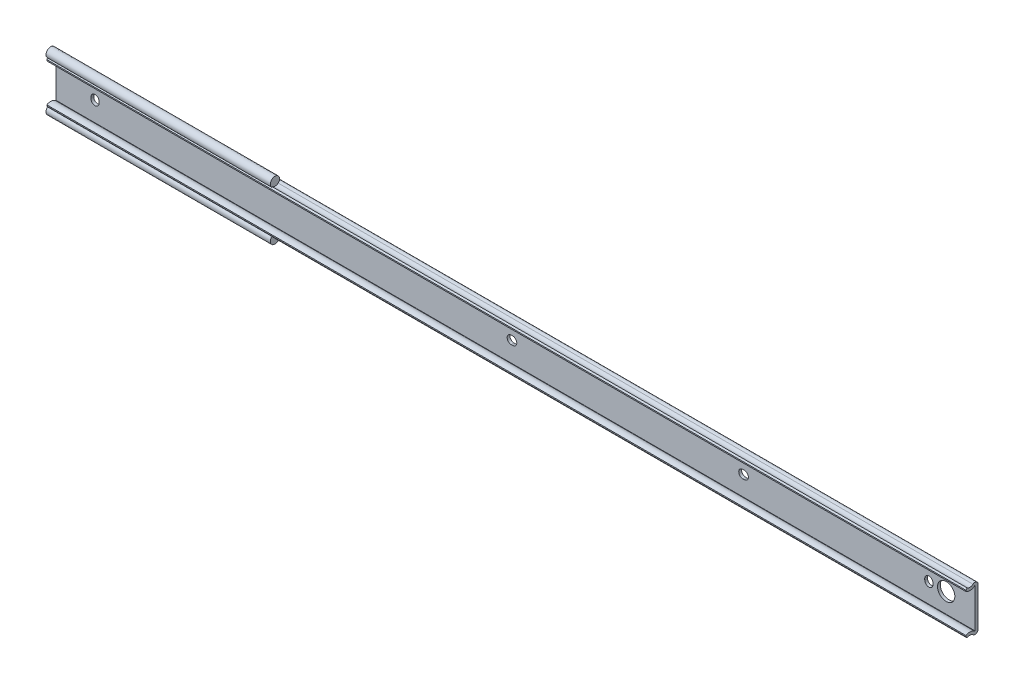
ISO-10303-21;
HEADER;
FILE_DESCRIPTION(('STEP AP214'),'2;1');
FILE_NAME('part.step','',(''),(''),'','','');
FILE_SCHEMA(('AUTOMOTIVE_DESIGN { 1 0 10303 214 1 1 1 1 }'));
ENDSEC;
DATA;
#1=APPLICATION_CONTEXT('core data for automotive mechanical design processes');
#2=APPLICATION_PROTOCOL_DEFINITION('international standard','automotive_design',2000,#1);
#3=PRODUCT_CONTEXT('',#1,'mechanical');
#4=PRODUCT('Part','Part','',(#3));
#5=PRODUCT_RELATED_PRODUCT_CATEGORY('part','',(#4));
#6=PRODUCT_DEFINITION_FORMATION('','',#4);
#7=PRODUCT_DEFINITION_CONTEXT('part definition',#1,'design');
#8=PRODUCT_DEFINITION('design','',#6,#7);
#9=PRODUCT_DEFINITION_SHAPE('','',#8);
#10=(LENGTH_UNIT() NAMED_UNIT(*) SI_UNIT(.MILLI.,.METRE.));
#11=(NAMED_UNIT(*) PLANE_ANGLE_UNIT() SI_UNIT($,.RADIAN.));
#12=(NAMED_UNIT(*) SI_UNIT($,.STERADIAN.) SOLID_ANGLE_UNIT());
#13=UNCERTAINTY_MEASURE_WITH_UNIT(LENGTH_MEASURE(1.E-05),#10,'distance_accuracy_value','');
#14=(GEOMETRIC_REPRESENTATION_CONTEXT(3) GLOBAL_UNCERTAINTY_ASSIGNED_CONTEXT((#13)) GLOBAL_UNIT_ASSIGNED_CONTEXT((#10,
#11,#12)) REPRESENTATION_CONTEXT('',''));
#15=CARTESIAN_POINT('',(0.,0.,0.));
#16=DIRECTION('',(0.,0.,1.));
#17=DIRECTION('',(1.,0.,0.));
#18=AXIS2_PLACEMENT_3D('',#15,#16,#17);
#19=CARTESIAN_POINT('',(-21.4,13.9150000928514,4.44999970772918));
#20=DIRECTION('',(1.,0.,0.));
#21=DIRECTION('',(0.,0.,-1.));
#22=AXIS2_PLACEMENT_3D('',#19,#20,#21);
#23=CYLINDRICAL_SURFACE('',#22,2.55000008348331);
#24=DIRECTION('',(1.,0.,0.));
#25=VECTOR('',#24,1.);
#26=CARTESIAN_POINT('',(-21.4,12.0053612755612,2.76009438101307));
#27=LINE('',#26,#25);
#28=CARTESIAN_POINT('',(101.6,12.0053612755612,2.76009438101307));
#29=VERTEX_POINT('',#28);
#30=CARTESIAN_POINT('',(482.6,12.0053612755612,2.76009438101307));
#31=VERTEX_POINT('',#30);
#32=EDGE_CURVE('E402',#29,#31,#27,.T.);
#33=ORIENTED_EDGE('',*,*,#32,.F.);
#34=CARTESIAN_POINT('',(101.6,13.9150000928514,4.44999970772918));
#35=DIRECTION('',(-1.,0.,0.));
#36=DIRECTION('',(0.,0.,1.));
#37=AXIS2_PLACEMENT_3D('',#34,#35,#36);
#38=CIRCLE('',#37,2.55000008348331);
#39=CARTESIAN_POINT('',(101.6,11.8784794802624,5.98462807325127));
#40=VERTEX_POINT('',#39);
#41=EDGE_CURVE('E466',#29,#40,#38,.T.);
#42=ORIENTED_EDGE('',*,*,#41,.T.);
#43=DIRECTION('',(1.,0.,0.));
#44=VECTOR('',#43,1.);
#45=CARTESIAN_POINT('',(-21.4,11.8784794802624,5.98462807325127));
#46=LINE('',#45,#44);
#47=CARTESIAN_POINT('',(482.6,11.8784794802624,5.98462807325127));
#48=VERTEX_POINT('',#47);
#49=EDGE_CURVE('E430',#40,#48,#46,.T.);
#50=ORIENTED_EDGE('',*,*,#49,.T.);
#51=CARTESIAN_POINT('',(482.6,13.9150000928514,4.44999970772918));
#52=DIRECTION('',(-1.,0.,0.));
#53=DIRECTION('',(0.,0.,-1.));
#54=AXIS2_PLACEMENT_3D('',#51,#52,#53);
#55=CIRCLE('',#54,2.55000008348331);
#56=EDGE_CURVE('E334',#31,#48,#55,.T.);
#57=ORIENTED_EDGE('',*,*,#56,.F.);
#58=EDGE_LOOP('',(#33,#42,#50,#57));
#59=FACE_BOUND('',#58,.T.);
#60=ADVANCED_FACE('F14',(#59),#23,.F.);
#61=CARTESIAN_POINT('',(-21.4,10.762224,1.65999962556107));
#62=DIRECTION('',(1.,0.,0.));
#63=DIRECTION('',(0.,0.,-1.));
#64=AXIS2_PLACEMENT_3D('',#61,#62,#63);
#65=CYLINDRICAL_SURFACE('',#64,1.65999962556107);
#66=DIRECTION('',(-1.,0.,0.));
#67=VECTOR('',#66,1.);
#68=CARTESIAN_POINT('',(40.1,12.2965303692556,2.29364205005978));
#69=LINE('',#68,#67);
#70=CARTESIAN_POINT('',(101.6,12.2965303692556,2.29364205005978));
#71=VERTEX_POINT('',#70);
#72=CARTESIAN_POINT('',(-21.4,12.2965303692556,2.29364205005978));
#73=VERTEX_POINT('',#72);
#74=EDGE_CURVE('E273',#71,#73,#69,.T.);
#75=ORIENTED_EDGE('',*,*,#74,.F.);
#76=CARTESIAN_POINT('',(101.6,10.762224,1.65999962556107));
#77=DIRECTION('',(-1.,0.,0.));
#78=DIRECTION('',(0.,0.,1.));
#79=AXIS2_PLACEMENT_3D('',#76,#77,#78);
#80=CIRCLE('',#79,1.65999962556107);
#81=EDGE_CURVE('E501',#71,#29,#80,.F.);
#82=ORIENTED_EDGE('',*,*,#81,.T.);
#83=ORIENTED_EDGE('',*,*,#32,.T.);
#84=CARTESIAN_POINT('',(482.6,10.762224,1.65999962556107));
#85=DIRECTION('',(1.,0.,0.));
#86=DIRECTION('',(0.,0.,-1.));
#87=AXIS2_PLACEMENT_3D('',#84,#85,#86);
#88=CIRCLE('',#87,1.65999962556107);
#89=CARTESIAN_POINT('',(482.6,10.762224,0.));
#90=VERTEX_POINT('',#89);
#91=EDGE_CURVE('E331',#90,#31,#88,.T.);
#92=ORIENTED_EDGE('',*,*,#91,.F.);
#93=DIRECTION('',(1.,0.,0.));
#94=VECTOR('',#93,1.);
#95=CARTESIAN_POINT('',(-21.4,10.762224,0.));
#96=LINE('',#95,#94);
#97=CARTESIAN_POINT('',(-21.4,10.762224,0.));
#98=VERTEX_POINT('',#97);
#99=EDGE_CURVE('E403',#98,#90,#96,.T.);
#100=ORIENTED_EDGE('',*,*,#99,.F.);
#101=CARTESIAN_POINT('',(-21.4,10.762224,1.65999962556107));
#102=DIRECTION('',(1.,0.,0.));
#103=DIRECTION('',(0.,0.,-1.));
#104=AXIS2_PLACEMENT_3D('',#101,#102,#103);
#105=CIRCLE('',#104,1.65999962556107);
#106=EDGE_CURVE('E372',#98,#73,#105,.T.);
#107=ORIENTED_EDGE('',*,*,#106,.T.);
#108=EDGE_LOOP('',(#75,#82,#83,#92,#100,#107));
#109=FACE_BOUND('',#108,.T.);
#110=ADVANCED_FACE('F16',(#109),#65,.T.);
#111=CARTESIAN_POINT('',(-21.4,-10.7622240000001,0.));
#112=DIRECTION('',(0.,0.,-1.));
#113=DIRECTION('',(-1.,0.,0.));
#114=AXIS2_PLACEMENT_3D('',#111,#112,#113);
#115=PLANE('',#114);
#116=CARTESIAN_POINT('',(466.7,0.,0.));
#117=DIRECTION('',(0.,0.,-1.));
#118=DIRECTION('',(-1.,0.,0.));
#119=AXIS2_PLACEMENT_3D('',#116,#117,#118);
#120=CIRCLE('',#119,4.75);
#121=CARTESIAN_POINT('',(461.95,0.,0.));
#122=VERTEX_POINT('',#121);
#123=EDGE_CURVE('E306',#122,#122,#120,.T.);
#124=ORIENTED_EDGE('',*,*,#123,.F.);
#125=EDGE_LOOP('',(#124));
#126=FACE_BOUND('',#125,.T.);
#127=CARTESIAN_POINT('',(229.000924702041,0.250209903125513,0.));
#128=DIRECTION('',(0.,0.,-1.));
#129=DIRECTION('',(-1.,0.,0.));
#130=AXIS2_PLACEMENT_3D('',#127,#128,#129);
#131=CIRCLE('',#130,2.25);
#132=CARTESIAN_POINT('',(229.000924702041,2.50020990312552,0.));
#133=VERTEX_POINT('',#132);
#134=CARTESIAN_POINT('',(229.000924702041,-1.99979009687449,0.));
#135=VERTEX_POINT('',#134);
#136=EDGE_CURVE('E270',#133,#135,#131,.T.);
#137=ORIENTED_EDGE('',*,*,#136,.F.);
#138=DIRECTION('',(1.,0.,0.));
#139=VECTOR('',#138,1.);
#140=CARTESIAN_POINT('',(229.000924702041,2.50020990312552,0.));
#141=LINE('',#140,#139);
#142=CARTESIAN_POINT('',(228.200924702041,2.50020990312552,0.));
#143=VERTEX_POINT('',#142);
#144=EDGE_CURVE('E279',#143,#133,#141,.T.);
#145=ORIENTED_EDGE('',*,*,#144,.F.);
#146=CARTESIAN_POINT('',(228.200924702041,0.250209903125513,0.));
#147=DIRECTION('',(0.,0.,-1.));
#148=DIRECTION('',(-1.,0.,0.));
#149=AXIS2_PLACEMENT_3D('',#146,#147,#148);
#150=CIRCLE('',#149,2.25);
#151=CARTESIAN_POINT('',(228.200924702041,-1.99979009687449,0.));
#152=VERTEX_POINT('',#151);
#153=EDGE_CURVE('E276',#152,#143,#150,.T.);
#154=ORIENTED_EDGE('',*,*,#153,.F.);
#155=DIRECTION('',(-1.,0.,0.));
#156=VECTOR('',#155,1.);
#157=CARTESIAN_POINT('',(229.000924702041,-1.99979009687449,0.));
#158=LINE('',#157,#156);
#159=EDGE_CURVE('E272',#135,#152,#158,.T.);
#160=ORIENTED_EDGE('',*,*,#159,.F.);
#161=EDGE_LOOP('',(#137,#145,#154,#160));
#162=FACE_BOUND('',#161,.T.);
#163=CARTESIAN_POINT('',(356.,0.,0.));
#164=DIRECTION('',(0.,0.,-1.));
#165=DIRECTION('',(-1.,0.,0.));
#166=AXIS2_PLACEMENT_3D('',#163,#164,#165);
#167=CIRCLE('',#166,2.25);
#168=CARTESIAN_POINT('',(356.,2.24999999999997,0.));
#169=VERTEX_POINT('',#168);
#170=CARTESIAN_POINT('',(356.,-2.25000000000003,0.));
#171=VERTEX_POINT('',#170);
#172=EDGE_CURVE('E255',#169,#171,#167,.T.);
#173=ORIENTED_EDGE('',*,*,#172,.F.);
#174=DIRECTION('',(1.,0.,0.));
#175=VECTOR('',#174,1.);
#176=CARTESIAN_POINT('',(356.,2.24999999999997,0.));
#177=LINE('',#176,#175);
#178=CARTESIAN_POINT('',(355.2,2.24999999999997,0.));
#179=VERTEX_POINT('',#178);
#180=EDGE_CURVE('E260',#179,#169,#177,.T.);
#181=ORIENTED_EDGE('',*,*,#180,.F.);
#182=CARTESIAN_POINT('',(355.2,0.,0.));
#183=DIRECTION('',(0.,0.,-1.));
#184=DIRECTION('',(-1.,0.,0.));
#185=AXIS2_PLACEMENT_3D('',#182,#183,#184);
#186=CIRCLE('',#185,2.25);
#187=CARTESIAN_POINT('',(355.2,-2.25000000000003,0.));
#188=VERTEX_POINT('',#187);
#189=EDGE_CURVE('E239',#188,#179,#186,.T.);
#190=ORIENTED_EDGE('',*,*,#189,.F.);
#191=DIRECTION('',(-1.,0.,0.));
#192=VECTOR('',#191,1.);
#193=CARTESIAN_POINT('',(356.,-2.25000000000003,0.));
#194=LINE('',#193,#192);
#195=EDGE_CURVE('E250',#171,#188,#194,.T.);
#196=ORIENTED_EDGE('',*,*,#195,.F.);
#197=EDGE_LOOP('',(#173,#181,#190,#196));
#198=FACE_BOUND('',#197,.T.);
#199=CARTESIAN_POINT('',(0.,0.4,0.));
#200=DIRECTION('',(0.,0.,-1.));
#201=DIRECTION('',(-1.,0.,0.));
#202=AXIS2_PLACEMENT_3D('',#199,#200,#201);
#203=CIRCLE('',#202,2.25000000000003);
#204=CARTESIAN_POINT('',(-2.25000000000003,0.4,0.));
#205=VERTEX_POINT('',#204);
#206=CARTESIAN_POINT('',(2.25000000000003,0.4,0.));
#207=VERTEX_POINT('',#206);
#208=EDGE_CURVE('E267',#205,#207,#203,.T.);
#209=ORIENTED_EDGE('',*,*,#208,.F.);
#210=DIRECTION('',(0.,1.,0.));
#211=VECTOR('',#210,1.);
#212=CARTESIAN_POINT('',(-2.25000000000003,0.4,0.));
#213=LINE('',#212,#211);
#214=CARTESIAN_POINT('',(-2.25000000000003,-0.4,0.));
#215=VERTEX_POINT('',#214);
#216=EDGE_CURVE('E320',#215,#205,#213,.T.);
#217=ORIENTED_EDGE('',*,*,#216,.F.);
#218=CARTESIAN_POINT('',(0.,-0.4,0.));
#219=DIRECTION('',(0.,0.,-1.));
#220=DIRECTION('',(-1.,0.,0.));
#221=AXIS2_PLACEMENT_3D('',#218,#219,#220);
#222=CIRCLE('',#221,2.25000000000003);
#223=CARTESIAN_POINT('',(2.25000000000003,-0.4,0.));
#224=VERTEX_POINT('',#223);
#225=EDGE_CURVE('E317',#224,#215,#222,.T.);
#226=ORIENTED_EDGE('',*,*,#225,.F.);
#227=DIRECTION('',(0.,-1.,0.));
#228=VECTOR('',#227,1.);
#229=CARTESIAN_POINT('',(2.25000000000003,0.4,0.));
#230=LINE('',#229,#228);
#231=EDGE_CURVE('E314',#207,#224,#230,.T.);
#232=ORIENTED_EDGE('',*,*,#231,.F.);
#233=EDGE_LOOP('',(#209,#217,#226,#232));
#234=FACE_BOUND('',#233,.T.);
#235=CARTESIAN_POINT('',(457.2,0.399999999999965,0.));
#236=DIRECTION('',(0.,0.,-1.));
#237=DIRECTION('',(-1.,0.,0.));
#238=AXIS2_PLACEMENT_3D('',#235,#236,#237);
#239=CIRCLE('',#238,2.25);
#240=CARTESIAN_POINT('',(454.95,0.399999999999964,0.));
#241=VERTEX_POINT('',#240);
#242=CARTESIAN_POINT('',(459.45,0.399999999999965,0.));
#243=VERTEX_POINT('',#242);
#244=EDGE_CURVE('E291',#241,#243,#239,.T.);
#245=ORIENTED_EDGE('',*,*,#244,.F.);
#246=DIRECTION('',(0.,1.,0.));
#247=VECTOR('',#246,1.);
#248=CARTESIAN_POINT('',(454.95,0.399999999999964,0.));
#249=LINE('',#248,#247);
#250=CARTESIAN_POINT('',(454.95,-0.400000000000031,0.));
#251=VERTEX_POINT('',#250);
#252=EDGE_CURVE('E300',#251,#241,#249,.T.);
#253=ORIENTED_EDGE('',*,*,#252,.F.);
#254=CARTESIAN_POINT('',(457.2,-0.400000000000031,0.));
#255=DIRECTION('',(0.,0.,-1.));
#256=DIRECTION('',(-1.,0.,0.));
#257=AXIS2_PLACEMENT_3D('',#254,#255,#256);
#258=CIRCLE('',#257,2.25);
#259=CARTESIAN_POINT('',(459.45,-0.400000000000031,0.));
#260=VERTEX_POINT('',#259);
#261=EDGE_CURVE('E297',#260,#251,#258,.T.);
#262=ORIENTED_EDGE('',*,*,#261,.F.);
#263=DIRECTION('',(0.,-1.,0.));
#264=VECTOR('',#263,1.);
#265=CARTESIAN_POINT('',(459.45,0.399999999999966,0.));
#266=LINE('',#265,#264);
#267=EDGE_CURVE('E293',#243,#260,#266,.T.);
#268=ORIENTED_EDGE('',*,*,#267,.F.);
#269=EDGE_LOOP('',(#245,#253,#262,#268));
#270=FACE_BOUND('',#269,.T.);
#271=ORIENTED_EDGE('',*,*,#99,.T.);
#272=DIRECTION('',(0.,1.,0.));
#273=VECTOR('',#272,1.);
#274=CARTESIAN_POINT('',(482.6,-10.7622240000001,0.));
#275=LINE('',#274,#273);
#276=CARTESIAN_POINT('',(482.6,-10.7622240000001,0.));
#277=VERTEX_POINT('',#276);
#278=EDGE_CURVE('E370',#277,#90,#275,.T.);
#279=ORIENTED_EDGE('',*,*,#278,.F.);
#280=DIRECTION('',(1.,0.,0.));
#281=VECTOR('',#280,1.);
#282=CARTESIAN_POINT('',(-21.4,-10.7622240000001,0.));
#283=LINE('',#282,#281);
#284=CARTESIAN_POINT('',(-21.4,-10.7622240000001,0.));
#285=VERTEX_POINT('',#284);
#286=EDGE_CURVE('E407',#285,#277,#283,.T.);
#287=ORIENTED_EDGE('',*,*,#286,.F.);
#288=DIRECTION('',(0.,1.,0.));
#289=VECTOR('',#288,1.);
#290=CARTESIAN_POINT('',(-21.4,-10.7622240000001,0.));
#291=LINE('',#290,#289);
#292=EDGE_CURVE('E400',#285,#98,#291,.T.);
#293=ORIENTED_EDGE('',*,*,#292,.T.);
#294=EDGE_LOOP('',(#271,#279,#287,#293));
#295=FACE_BOUND('',#294,.T.);
#296=ADVANCED_FACE('F257',(#126,#162,#198,#234,#270,#295),#115,.T.);
#297=CARTESIAN_POINT('',(-21.4,-10.7622240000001,1.65999962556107));
#298=DIRECTION('',(1.,0.,0.));
#299=DIRECTION('',(0.,0.,-1.));
#300=AXIS2_PLACEMENT_3D('',#297,#298,#299);
#301=CYLINDRICAL_SURFACE('',#300,1.65999962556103);
#302=DIRECTION('',(-1.,0.,0.));
#303=VECTOR('',#302,1.);
#304=CARTESIAN_POINT('',(40.1,-12.2965303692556,2.29364205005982));
#305=LINE('',#304,#303);
#306=CARTESIAN_POINT('',(-21.4,-12.2965303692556,2.29364205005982));
#307=VERTEX_POINT('',#306);
#308=CARTESIAN_POINT('',(101.6,-12.2965303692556,2.29364205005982));
#309=VERTEX_POINT('',#308);
#310=EDGE_CURVE('E33',#307,#309,#305,.F.);
#311=ORIENTED_EDGE('',*,*,#310,.F.);
#312=CARTESIAN_POINT('',(-21.4,-10.7622240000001,1.65999962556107));
#313=DIRECTION('',(1.,0.,0.));
#314=DIRECTION('',(0.,0.,1.));
#315=AXIS2_PLACEMENT_3D('',#312,#313,#314);
#316=CIRCLE('',#315,1.65999962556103);
#317=EDGE_CURVE('E398',#307,#285,#316,.T.);
#318=ORIENTED_EDGE('',*,*,#317,.T.);
#319=ORIENTED_EDGE('',*,*,#286,.T.);
#320=CARTESIAN_POINT('',(482.6,-10.7622240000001,1.65999962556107));
#321=DIRECTION('',(1.,0.,0.));
#322=DIRECTION('',(0.,0.,1.));
#323=AXIS2_PLACEMENT_3D('',#320,#321,#322);
#324=CIRCLE('',#323,1.65999962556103);
#325=CARTESIAN_POINT('',(482.6,-12.0036867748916,2.76198371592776));
#326=VERTEX_POINT('',#325);
#327=EDGE_CURVE('E367',#326,#277,#324,.T.);
#328=ORIENTED_EDGE('',*,*,#327,.F.);
#329=DIRECTION('',(1.,0.,0.));
#330=VECTOR('',#329,1.);
#331=CARTESIAN_POINT('',(-21.4,-12.0036867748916,2.76198371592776));
#332=LINE('',#331,#330);
#333=CARTESIAN_POINT('',(101.6,-12.0036867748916,2.76198371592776));
#334=VERTEX_POINT('',#333);
#335=EDGE_CURVE('E409',#334,#326,#332,.T.);
#336=ORIENTED_EDGE('',*,*,#335,.F.);
#337=CARTESIAN_POINT('',(101.6,-10.7622240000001,1.65999962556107));
#338=DIRECTION('',(1.,0.,0.));
#339=DIRECTION('',(0.,0.,-1.));
#340=AXIS2_PLACEMENT_3D('',#337,#338,#339);
#341=CIRCLE('',#340,1.65999962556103);
#342=EDGE_CURVE('E29',#309,#334,#341,.F.);
#343=ORIENTED_EDGE('',*,*,#342,.F.);
#344=EDGE_LOOP('',(#311,#318,#319,#328,#336,#343));
#345=FACE_BOUND('',#344,.T.);
#346=ADVANCED_FACE('F518',(#345),#301,.T.);
#347=CARTESIAN_POINT('',(-21.4,-10.7845049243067,1.54999983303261));
#348=DIRECTION('',(0.,0.,1.));
#349=DIRECTION('',(0.,-1.,0.));
#350=AXIS2_PLACEMENT_3D('',#347,#348,#349);
#351=PLANE('',#350);
#352=CARTESIAN_POINT('',(466.7,0.,1.54999983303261));
#353=DIRECTION('',(0.,0.,1.));
#354=DIRECTION('',(0.,-1.,0.));
#355=AXIS2_PLACEMENT_3D('',#352,#353,#354);
#356=CIRCLE('',#355,4.75);
#357=CARTESIAN_POINT('',(466.7,-4.75000000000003,1.54999983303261));
#358=VERTEX_POINT('',#357);
#359=EDGE_CURVE('E335',#358,#358,#356,.T.);
#360=ORIENTED_EDGE('',*,*,#359,.F.);
#361=EDGE_LOOP('',(#360));
#362=FACE_BOUND('',#361,.T.);
#363=CARTESIAN_POINT('',(229.000924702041,0.250209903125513,1.54999983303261));
#364=DIRECTION('',(0.,0.,1.));
#365=DIRECTION('',(0.,-1.,0.));
#366=AXIS2_PLACEMENT_3D('',#363,#364,#365);
#367=CIRCLE('',#366,2.25);
#368=CARTESIAN_POINT('',(229.000924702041,-1.99979009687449,1.54999983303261));
#369=VERTEX_POINT('',#368);
#370=CARTESIAN_POINT('',(229.000924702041,2.50020990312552,1.54999983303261));
#371=VERTEX_POINT('',#370);
#372=EDGE_CURVE('E464',#369,#371,#367,.T.);
#373=ORIENTED_EDGE('',*,*,#372,.F.);
#374=DIRECTION('',(1.,0.,0.));
#375=VECTOR('',#374,1.);
#376=CARTESIAN_POINT('',(-21.4,-1.99979009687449,1.54999983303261));
#377=LINE('',#376,#375);
#378=CARTESIAN_POINT('',(228.200924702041,-1.99979009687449,1.54999983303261));
#379=VERTEX_POINT('',#378);
#380=EDGE_CURVE('E457',#379,#369,#377,.T.);
#381=ORIENTED_EDGE('',*,*,#380,.F.);
#382=CARTESIAN_POINT('',(228.200924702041,0.250209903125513,1.54999983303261));
#383=DIRECTION('',(0.,0.,1.));
#384=DIRECTION('',(0.,-1.,0.));
#385=AXIS2_PLACEMENT_3D('',#382,#383,#384);
#386=CIRCLE('',#385,2.25);
#387=CARTESIAN_POINT('',(228.200924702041,2.50020990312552,1.54999983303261));
#388=VERTEX_POINT('',#387);
#389=EDGE_CURVE('E459',#388,#379,#386,.T.);
#390=ORIENTED_EDGE('',*,*,#389,.F.);
#391=DIRECTION('',(-1.,0.,0.));
#392=VECTOR('',#391,1.);
#393=CARTESIAN_POINT('',(-21.4,2.50020990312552,1.54999983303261));
#394=LINE('',#393,#392);
#395=EDGE_CURVE('E462',#371,#388,#394,.T.);
#396=ORIENTED_EDGE('',*,*,#395,.F.);
#397=EDGE_LOOP('',(#373,#381,#390,#396));
#398=FACE_BOUND('',#397,.T.);
#399=CARTESIAN_POINT('',(356.,0.,1.54999983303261));
#400=DIRECTION('',(0.,0.,1.));
#401=DIRECTION('',(0.,-1.,0.));
#402=AXIS2_PLACEMENT_3D('',#399,#400,#401);
#403=CIRCLE('',#402,2.25);
#404=CARTESIAN_POINT('',(356.,-2.25000000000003,1.54999983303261));
#405=VERTEX_POINT('',#404);
#406=CARTESIAN_POINT('',(356.,2.24999999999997,1.54999983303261));
#407=VERTEX_POINT('',#406);
#408=EDGE_CURVE('E455',#405,#407,#403,.T.);
#409=ORIENTED_EDGE('',*,*,#408,.F.);
#410=DIRECTION('',(1.,0.,0.));
#411=VECTOR('',#410,1.);
#412=CARTESIAN_POINT('',(-21.4,-2.25000000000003,1.54999983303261));
#413=LINE('',#412,#411);
#414=CARTESIAN_POINT('',(355.2,-2.25000000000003,1.54999983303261));
#415=VERTEX_POINT('',#414);
#416=EDGE_CURVE('E450',#415,#405,#413,.T.);
#417=ORIENTED_EDGE('',*,*,#416,.F.);
#418=CARTESIAN_POINT('',(355.2,0.,1.54999983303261));
#419=DIRECTION('',(0.,0.,1.));
#420=DIRECTION('',(0.,-1.,0.));
#421=AXIS2_PLACEMENT_3D('',#418,#419,#420);
#422=CIRCLE('',#421,2.25);
#423=CARTESIAN_POINT('',(355.2,2.24999999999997,1.54999983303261));
#424=VERTEX_POINT('',#423);
#425=EDGE_CURVE('E242',#424,#415,#422,.T.);
#426=ORIENTED_EDGE('',*,*,#425,.F.);
#427=DIRECTION('',(-1.,0.,0.));
#428=VECTOR('',#427,1.);
#429=CARTESIAN_POINT('',(-21.4,2.24999999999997,1.54999983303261));
#430=LINE('',#429,#428);
#431=EDGE_CURVE('E453',#407,#424,#430,.T.);
#432=ORIENTED_EDGE('',*,*,#431,.F.);
#433=EDGE_LOOP('',(#409,#417,#426,#432));
#434=FACE_BOUND('',#433,.T.);
#435=CARTESIAN_POINT('',(0.,0.4,1.54999983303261));
#436=DIRECTION('',(0.,0.,1.));
#437=DIRECTION('',(0.,-1.,0.));
#438=AXIS2_PLACEMENT_3D('',#435,#436,#437);
#439=CIRCLE('',#438,2.25000000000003);
#440=CARTESIAN_POINT('',(2.25000000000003,0.4,1.54999983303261));
#441=VERTEX_POINT('',#440);
#442=CARTESIAN_POINT('',(-2.25000000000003,0.4,1.54999983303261));
#443=VERTEX_POINT('',#442);
#444=EDGE_CURVE('E448',#441,#443,#439,.T.);
#445=ORIENTED_EDGE('',*,*,#444,.F.);
#446=DIRECTION('',(0.,1.,0.));
#447=VECTOR('',#446,1.);
#448=CARTESIAN_POINT('',(2.25000000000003,-10.7845049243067,1.54999983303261));
#449=LINE('',#448,#447);
#450=CARTESIAN_POINT('',(2.25000000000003,-0.4,1.54999983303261));
#451=VERTEX_POINT('',#450);
#452=EDGE_CURVE('E441',#451,#441,#449,.T.);
#453=ORIENTED_EDGE('',*,*,#452,.F.);
#454=CARTESIAN_POINT('',(0.,-0.4,1.54999983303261));
#455=DIRECTION('',(0.,0.,1.));
#456=DIRECTION('',(0.,-1.,0.));
#457=AXIS2_PLACEMENT_3D('',#454,#455,#456);
#458=CIRCLE('',#457,2.25000000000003);
#459=CARTESIAN_POINT('',(-2.25000000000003,-0.4,1.54999983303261));
#460=VERTEX_POINT('',#459);
#461=EDGE_CURVE('E443',#460,#451,#458,.T.);
#462=ORIENTED_EDGE('',*,*,#461,.F.);
#463=DIRECTION('',(0.,-1.,0.));
#464=VECTOR('',#463,1.);
#465=CARTESIAN_POINT('',(-2.25000000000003,-10.7845049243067,1.54999983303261));
#466=LINE('',#465,#464);
#467=EDGE_CURVE('E446',#443,#460,#466,.T.);
#468=ORIENTED_EDGE('',*,*,#467,.F.);
#469=EDGE_LOOP('',(#445,#453,#462,#468));
#470=FACE_BOUND('',#469,.T.);
#471=CARTESIAN_POINT('',(457.2,0.399999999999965,1.54999983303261));
#472=DIRECTION('',(0.,0.,1.));
#473=DIRECTION('',(0.,-1.,0.));
#474=AXIS2_PLACEMENT_3D('',#471,#472,#473);
#475=CIRCLE('',#474,2.25);
#476=CARTESIAN_POINT('',(459.45,0.399999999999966,1.54999983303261));
#477=VERTEX_POINT('',#476);
#478=CARTESIAN_POINT('',(454.95,0.399999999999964,1.54999983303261));
#479=VERTEX_POINT('',#478);
#480=EDGE_CURVE('E439',#477,#479,#475,.T.);
#481=ORIENTED_EDGE('',*,*,#480,.F.);
#482=DIRECTION('',(0.,1.,0.));
#483=VECTOR('',#482,1.);
#484=CARTESIAN_POINT('',(459.45,-10.7845049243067,1.54999983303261));
#485=LINE('',#484,#483);
#486=CARTESIAN_POINT('',(459.45,-0.400000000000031,1.54999983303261));
#487=VERTEX_POINT('',#486);
#488=EDGE_CURVE('E406',#487,#477,#485,.T.);
#489=ORIENTED_EDGE('',*,*,#488,.F.);
#490=CARTESIAN_POINT('',(457.2,-0.400000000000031,1.54999983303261));
#491=DIRECTION('',(0.,0.,1.));
#492=DIRECTION('',(0.,-1.,0.));
#493=AXIS2_PLACEMENT_3D('',#490,#491,#492);
#494=CIRCLE('',#493,2.25);
#495=CARTESIAN_POINT('',(454.95,-0.400000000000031,1.54999983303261));
#496=VERTEX_POINT('',#495);
#497=EDGE_CURVE('E434',#496,#487,#494,.T.);
#498=ORIENTED_EDGE('',*,*,#497,.F.);
#499=DIRECTION('',(0.,-1.,0.));
#500=VECTOR('',#499,1.);
#501=CARTESIAN_POINT('',(454.95,-10.7845049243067,1.54999983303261));
#502=LINE('',#501,#500);
#503=EDGE_CURVE('E437',#479,#496,#502,.T.);
#504=ORIENTED_EDGE('',*,*,#503,.F.);
#505=EDGE_LOOP('',(#481,#489,#498,#504));
#506=FACE_BOUND('',#505,.T.);
#507=DIRECTION('',(0.,-1.,0.));
#508=VECTOR('',#507,1.);
#509=CARTESIAN_POINT('',(-21.4,-10.7845049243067,1.54999983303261));
#510=LINE('',#509,#508);
#511=CARTESIAN_POINT('',(-21.4,10.7845049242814,1.54999983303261));
#512=VERTEX_POINT('',#511);
#513=CARTESIAN_POINT('',(-21.4,-10.7845049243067,1.54999983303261));
#514=VERTEX_POINT('',#513);
#515=EDGE_CURVE('E385',#512,#514,#510,.T.);
#516=ORIENTED_EDGE('',*,*,#515,.T.);
#517=DIRECTION('',(1.,0.,0.));
#518=VECTOR('',#517,1.);
#519=CARTESIAN_POINT('',(-21.4,-10.7845049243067,1.54999983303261));
#520=LINE('',#519,#518);
#521=CARTESIAN_POINT('',(482.6,-10.7845049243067,1.54999983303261));
#522=VERTEX_POINT('',#521);
#523=EDGE_CURVE('E419',#514,#522,#520,.T.);
#524=ORIENTED_EDGE('',*,*,#523,.T.);
#525=DIRECTION('',(0.,-1.,0.));
#526=VECTOR('',#525,1.);
#527=CARTESIAN_POINT('',(482.6,-10.7845049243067,1.54999983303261));
#528=LINE('',#527,#526);
#529=CARTESIAN_POINT('',(482.6,10.7845049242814,1.54999983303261));
#530=VERTEX_POINT('',#529);
#531=EDGE_CURVE('E350',#530,#522,#528,.T.);
#532=ORIENTED_EDGE('',*,*,#531,.F.);
#533=DIRECTION('',(1.,0.,0.));
#534=VECTOR('',#533,1.);
#535=CARTESIAN_POINT('',(-21.4,10.7845049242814,1.54999983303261));
#536=LINE('',#535,#534);
#537=EDGE_CURVE('E422',#512,#530,#536,.T.);
#538=ORIENTED_EDGE('',*,*,#537,.F.);
#539=EDGE_LOOP('',(#516,#524,#532,#538));
#540=FACE_BOUND('',#539,.T.);
#541=ADVANCED_FACE('F514',(#362,#398,#434,#470,#506,#540),#351,.T.);
#542=CARTESIAN_POINT('',(-21.4,10.762224,1.65999962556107));
#543=DIRECTION('',(1.,0.,0.));
#544=DIRECTION('',(0.,0.,-1.));
#545=AXIS2_PLACEMENT_3D('',#542,#543,#544);
#546=PLANE('',#545);
#547=ORIENTED_EDGE('',*,*,#317,.F.);
#548=CARTESIAN_POINT('',(-21.4,-13.575,4.5));
#549=DIRECTION('',(-1.,0.,0.));
#550=DIRECTION('',(0.,0.,-1.));
#551=AXIS2_PLACEMENT_3D('',#548,#549,#550);
#552=CIRCLE('',#551,2.55);
#553=CARTESIAN_POINT('',(-21.4,-11.641839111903,6.16294587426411));
#554=VERTEX_POINT('',#553);
#555=EDGE_CURVE('E486',#307,#554,#552,.T.);
#556=ORIENTED_EDGE('',*,*,#555,.T.);
#557=DIRECTION('',(0.,-0.798635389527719,-0.601815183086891));
#558=VECTOR('',#557,1.);
#559=CARTESIAN_POINT('',(-21.4,-11.8784773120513,5.98462612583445));
#560=LINE('',#559,#558);
#561=CARTESIAN_POINT('',(-21.4,-11.0618545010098,6.59999580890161));
#562=VERTEX_POINT('',#561);
#563=EDGE_CURVE('E396',#562,#554,#560,.T.);
#564=ORIENTED_EDGE('',*,*,#563,.F.);
#565=DIRECTION('',(0.,-1.,0.));
#566=VECTOR('',#565,1.);
#567=CARTESIAN_POINT('',(-21.4,-11.0618545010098,6.59999580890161));
#568=LINE('',#567,#566);
#569=CARTESIAN_POINT('',(-21.4,-10.4239404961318,6.59999580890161));
#570=VERTEX_POINT('',#569);
#571=EDGE_CURVE('E393',#570,#562,#568,.T.);
#572=ORIENTED_EDGE('',*,*,#571,.F.);
#573=CARTESIAN_POINT('',(-21.4,-13.9149976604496,4.44999754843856));
#574=DIRECTION('',(1.,0.,0.));
#575=DIRECTION('',(0.,0.,1.));
#576=AXIS2_PLACEMENT_3D('',#573,#574,#575);
#577=CIRCLE('',#576,4.09999666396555);
#578=CARTESIAN_POINT('',(-21.4,-10.8590405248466,1.71666649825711));
#579=VERTEX_POINT('',#578);
#580=EDGE_CURVE('E390',#579,#570,#577,.T.);
#581=ORIENTED_EDGE('',*,*,#580,.F.);
#582=CARTESIAN_POINT('',(-21.4,-10.7845049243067,1.64999983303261));
#583=DIRECTION('',(-1.,0.,0.));
#584=DIRECTION('',(0.,0.,-1.));
#585=AXIS2_PLACEMENT_3D('',#582,#583,#584);
#586=CIRCLE('',#585,0.1);
#587=EDGE_CURVE('E387',#514,#579,#586,.T.);
#588=ORIENTED_EDGE('',*,*,#587,.F.);
#589=ORIENTED_EDGE('',*,*,#515,.F.);
#590=CARTESIAN_POINT('',(-21.4,10.7845049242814,1.64999983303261));
#591=DIRECTION('',(-1.,0.,0.));
#592=DIRECTION('',(0.,0.,1.));
#593=AXIS2_PLACEMENT_3D('',#590,#591,#592);
#594=CIRCLE('',#593,0.1);
#595=CARTESIAN_POINT('',(-21.4,10.8590405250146,1.71666649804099));
#596=VERTEX_POINT('',#595);
#597=EDGE_CURVE('E382',#596,#512,#594,.T.);
#598=ORIENTED_EDGE('',*,*,#597,.F.);
#599=CARTESIAN_POINT('',(-21.4,13.9150000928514,4.44999970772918));
#600=DIRECTION('',(1.,0.,0.));
#601=DIRECTION('',(0.,0.,-1.));
#602=AXIS2_PLACEMENT_3D('',#599,#600,#601);
#603=CIRCLE('',#602,4.09999991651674);
#604=CARTESIAN_POINT('',(-21.4,10.4239401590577,6.59999967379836));
#605=VERTEX_POINT('',#604);
#606=EDGE_CURVE('E379',#605,#596,#603,.T.);
#607=ORIENTED_EDGE('',*,*,#606,.F.);
#608=DIRECTION('',(0.,-1.,1.54366169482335E-08));
#609=VECTOR('',#608,1.);
#610=CARTESIAN_POINT('',(-21.4,11.0618541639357,6.59999966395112));
#611=LINE('',#610,#609);
#612=CARTESIAN_POINT('',(-21.4,11.0618541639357,6.59999966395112));
#613=VERTEX_POINT('',#612);
#614=EDGE_CURVE('E376',#613,#605,#611,.T.);
#615=ORIENTED_EDGE('',*,*,#614,.F.);
#616=DIRECTION('',(0.,-0.798635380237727,0.601815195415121));
#617=VECTOR('',#616,1.);
#618=CARTESIAN_POINT('',(-21.4,11.8784794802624,5.98462807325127));
#619=LINE('',#618,#617);
#620=CARTESIAN_POINT('',(-21.4,11.6418409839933,6.16294805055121));
#621=VERTEX_POINT('',#620);
#622=EDGE_CURVE('E374',#621,#613,#619,.T.);
#623=ORIENTED_EDGE('',*,*,#622,.F.);
#624=CARTESIAN_POINT('',(-21.4,13.575,4.5));
#625=DIRECTION('',(-1.,0.,0.));
#626=DIRECTION('',(0.,0.,1.));
#627=AXIS2_PLACEMENT_3D('',#624,#625,#626);
#628=CIRCLE('',#627,2.55);
#629=EDGE_CURVE('E493',#621,#73,#628,.T.);
#630=ORIENTED_EDGE('',*,*,#629,.T.);
#631=ORIENTED_EDGE('',*,*,#106,.F.);
#632=ORIENTED_EDGE('',*,*,#292,.F.);
#633=EDGE_LOOP('',(#547,#556,#564,#572,#581,#588,#589,#598,#607,#615,#623,#630,#631,#632));
#634=FACE_BOUND('',#633,.T.);
#635=ADVANCED_FACE('F517',(#634),#546,.F.);
#636=CARTESIAN_POINT('',(482.6,10.762224,1.65999962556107));
#637=DIRECTION('',(1.,0.,0.));
#638=DIRECTION('',(0.,0.,-1.));
#639=AXIS2_PLACEMENT_3D('',#636,#637,#638);
#640=PLANE('',#639);
#641=ORIENTED_EDGE('',*,*,#531,.T.);
#642=CARTESIAN_POINT('',(482.6,-10.7845049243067,1.64999983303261));
#643=DIRECTION('',(-1.,0.,0.));
#644=DIRECTION('',(0.,0.,-1.));
#645=AXIS2_PLACEMENT_3D('',#642,#643,#644);
#646=CIRCLE('',#645,0.1);
#647=CARTESIAN_POINT('',(482.6,-10.8590405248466,1.71666649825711));
#648=VERTEX_POINT('',#647);
#649=EDGE_CURVE('E352',#522,#648,#646,.T.);
#650=ORIENTED_EDGE('',*,*,#649,.T.);
#651=CARTESIAN_POINT('',(482.6,-13.9149976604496,4.44999754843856));
#652=DIRECTION('',(1.,0.,0.));
#653=DIRECTION('',(0.,0.,1.));
#654=AXIS2_PLACEMENT_3D('',#651,#652,#653);
#655=CIRCLE('',#654,4.09999666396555);
#656=CARTESIAN_POINT('',(482.6,-10.4239404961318,6.59999580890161));
#657=VERTEX_POINT('',#656);
#658=EDGE_CURVE('E355',#648,#657,#655,.T.);
#659=ORIENTED_EDGE('',*,*,#658,.T.);
#660=DIRECTION('',(0.,-1.,0.));
#661=VECTOR('',#660,1.);
#662=CARTESIAN_POINT('',(482.6,-11.0618545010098,6.59999580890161));
#663=LINE('',#662,#661);
#664=CARTESIAN_POINT('',(482.6,-11.0618545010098,6.59999580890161));
#665=VERTEX_POINT('',#664);
#666=EDGE_CURVE('E358',#657,#665,#663,.T.);
#667=ORIENTED_EDGE('',*,*,#666,.T.);
#668=DIRECTION('',(0.,-0.798635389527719,-0.601815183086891));
#669=VECTOR('',#668,1.);
#670=CARTESIAN_POINT('',(482.6,-11.8784773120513,5.98462612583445));
#671=LINE('',#670,#669);
#672=CARTESIAN_POINT('',(482.6,-11.8784773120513,5.98462612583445));
#673=VERTEX_POINT('',#672);
#674=EDGE_CURVE('E361',#665,#673,#671,.T.);
#675=ORIENTED_EDGE('',*,*,#674,.T.);
#676=CARTESIAN_POINT('',(482.6,-13.9149976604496,4.44999754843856));
#677=DIRECTION('',(-1.,0.,0.));
#678=DIRECTION('',(0.,0.,1.));
#679=AXIS2_PLACEMENT_3D('',#676,#677,#678);
#680=CIRCLE('',#679,2.55000000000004);
#681=EDGE_CURVE('E364',#673,#326,#680,.T.);
#682=ORIENTED_EDGE('',*,*,#681,.T.);
#683=ORIENTED_EDGE('',*,*,#327,.T.);
#684=ORIENTED_EDGE('',*,*,#278,.T.);
#685=ORIENTED_EDGE('',*,*,#91,.T.);
#686=ORIENTED_EDGE('',*,*,#56,.T.);
#687=DIRECTION('',(0.,-0.798635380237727,0.601815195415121));
#688=VECTOR('',#687,1.);
#689=CARTESIAN_POINT('',(482.6,11.8784794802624,5.98462807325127));
#690=LINE('',#689,#688);
#691=CARTESIAN_POINT('',(482.6,11.0618541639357,6.59999966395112));
#692=VERTEX_POINT('',#691);
#693=EDGE_CURVE('E338',#48,#692,#690,.T.);
#694=ORIENTED_EDGE('',*,*,#693,.T.);
#695=DIRECTION('',(0.,-1.,1.54366169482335E-08));
#696=VECTOR('',#695,1.);
#697=CARTESIAN_POINT('',(482.6,11.0618541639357,6.59999966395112));
#698=LINE('',#697,#696);
#699=CARTESIAN_POINT('',(482.6,10.4239401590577,6.59999967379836));
#700=VERTEX_POINT('',#699);
#701=EDGE_CURVE('E341',#692,#700,#698,.T.);
#702=ORIENTED_EDGE('',*,*,#701,.T.);
#703=CARTESIAN_POINT('',(482.6,13.9150000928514,4.44999970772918));
#704=DIRECTION('',(1.,0.,0.));
#705=DIRECTION('',(0.,0.,-1.));
#706=AXIS2_PLACEMENT_3D('',#703,#704,#705);
#707=CIRCLE('',#706,4.09999991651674);
#708=CARTESIAN_POINT('',(482.6,10.8590405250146,1.71666649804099));
#709=VERTEX_POINT('',#708);
#710=EDGE_CURVE('E344',#700,#709,#707,.T.);
#711=ORIENTED_EDGE('',*,*,#710,.T.);
#712=CARTESIAN_POINT('',(482.6,10.7845049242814,1.64999983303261));
#713=DIRECTION('',(-1.,0.,0.));
#714=DIRECTION('',(0.,0.,1.));
#715=AXIS2_PLACEMENT_3D('',#712,#713,#714);
#716=CIRCLE('',#715,0.1);
#717=EDGE_CURVE('E347',#709,#530,#716,.T.);
#718=ORIENTED_EDGE('',*,*,#717,.T.);
#719=EDGE_LOOP('',(#641,#650,#659,#667,#675,#682,#683,#684,#685,#686,#694,#702,#711,#718));
#720=FACE_BOUND('',#719,.T.);
#721=ADVANCED_FACE('F546',(#720),#640,.T.);
#722=CARTESIAN_POINT('',(-21.4,-13.9149976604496,4.44999754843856));
#723=DIRECTION('',(1.,0.,0.));
#724=DIRECTION('',(0.,0.,-1.));
#725=AXIS2_PLACEMENT_3D('',#722,#723,#724);
#726=CYLINDRICAL_SURFACE('',#725,2.55000000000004);
#727=CARTESIAN_POINT('',(101.6,-13.9149976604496,4.44999754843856));
#728=DIRECTION('',(1.,0.,0.));
#729=DIRECTION('',(0.,0.,-1.));
#730=AXIS2_PLACEMENT_3D('',#727,#728,#729);
#731=CIRCLE('',#730,2.55000000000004);
#732=CARTESIAN_POINT('',(101.6,-11.8784773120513,5.98462612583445));
#733=VERTEX_POINT('',#732);
#734=EDGE_CURVE('E479',#334,#733,#731,.T.);
#735=ORIENTED_EDGE('',*,*,#734,.F.);
#736=ORIENTED_EDGE('',*,*,#335,.T.);
#737=ORIENTED_EDGE('',*,*,#681,.F.);
#738=DIRECTION('',(1.,0.,0.));
#739=VECTOR('',#738,1.);
#740=CARTESIAN_POINT('',(-21.4,-11.8784773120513,5.98462612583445));
#741=LINE('',#740,#739);
#742=EDGE_CURVE('E411',#733,#673,#741,.T.);
#743=ORIENTED_EDGE('',*,*,#742,.F.);
#744=EDGE_LOOP('',(#735,#736,#737,#743));
#745=FACE_BOUND('',#744,.T.);
#746=ADVANCED_FACE('F588',(#745),#726,.F.);
#747=CARTESIAN_POINT('',(-21.4,-11.8784773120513,5.98462612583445));
#748=DIRECTION('',(0.,-0.601815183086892,0.798635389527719));
#749=DIRECTION('',(0.,-0.798635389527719,-0.601815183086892));
#750=AXIS2_PLACEMENT_3D('',#747,#748,#749);
#751=PLANE('',#750);
#752=DIRECTION('',(-1.,0.,0.));
#753=VECTOR('',#752,1.);
#754=CARTESIAN_POINT('',(101.6,-11.641839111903,6.16294587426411));
#755=LINE('',#754,#753);
#756=CARTESIAN_POINT('',(101.6,-11.641839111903,6.16294587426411));
#757=VERTEX_POINT('',#756);
#758=EDGE_CURVE('E9',#757,#554,#755,.T.);
#759=ORIENTED_EDGE('',*,*,#758,.F.);
#760=DIRECTION('',(0.,0.798635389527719,0.601815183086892));
#761=VECTOR('',#760,1.);
#762=CARTESIAN_POINT('',(101.6,-11.8784773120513,5.98462612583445));
#763=LINE('',#762,#761);
#764=EDGE_CURVE('E22',#733,#757,#763,.T.);
#765=ORIENTED_EDGE('',*,*,#764,.F.);
#766=ORIENTED_EDGE('',*,*,#742,.T.);
#767=ORIENTED_EDGE('',*,*,#674,.F.);
#768=DIRECTION('',(1.,0.,0.));
#769=VECTOR('',#768,1.);
#770=CARTESIAN_POINT('',(-21.4,-11.0618545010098,6.59999580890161));
#771=LINE('',#770,#769);
#772=EDGE_CURVE('E413',#562,#665,#771,.T.);
#773=ORIENTED_EDGE('',*,*,#772,.F.);
#774=ORIENTED_EDGE('',*,*,#563,.T.);
#775=EDGE_LOOP('',(#759,#765,#766,#767,#773,#774));
#776=FACE_BOUND('',#775,.T.);
#777=ADVANCED_FACE('F589',(#776),#751,.T.);
#778=CARTESIAN_POINT('',(-21.4,-11.0618545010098,6.59999580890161));
#779=DIRECTION('',(0.,0.,1.));
#780=DIRECTION('',(1.,0.,0.));
#781=AXIS2_PLACEMENT_3D('',#778,#779,#780);
#782=PLANE('',#781);
#783=ORIENTED_EDGE('',*,*,#666,.F.);
#784=DIRECTION('',(1.,0.,0.));
#785=VECTOR('',#784,1.);
#786=CARTESIAN_POINT('',(-21.4,-10.4239404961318,6.59999580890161));
#787=LINE('',#786,#785);
#788=EDGE_CURVE('E415',#570,#657,#787,.T.);
#789=ORIENTED_EDGE('',*,*,#788,.F.);
#790=ORIENTED_EDGE('',*,*,#571,.T.);
#791=ORIENTED_EDGE('',*,*,#772,.T.);
#792=EDGE_LOOP('',(#783,#789,#790,#791));
#793=FACE_BOUND('',#792,.T.);
#794=ADVANCED_FACE('F591',(#793),#782,.T.);
#795=CARTESIAN_POINT('',(-21.4,-13.9149976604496,4.44999754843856));
#796=DIRECTION('',(1.,0.,0.));
#797=DIRECTION('',(0.,0.,-1.));
#798=AXIS2_PLACEMENT_3D('',#795,#796,#797);
#799=CYLINDRICAL_SURFACE('',#798,4.09999666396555);
#800=ORIENTED_EDGE('',*,*,#658,.F.);
#801=DIRECTION('',(1.,0.,0.));
#802=VECTOR('',#801,1.);
#803=CARTESIAN_POINT('',(-21.4,-10.8590405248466,1.71666649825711));
#804=LINE('',#803,#802);
#805=EDGE_CURVE('E417',#579,#648,#804,.T.);
#806=ORIENTED_EDGE('',*,*,#805,.F.);
#807=ORIENTED_EDGE('',*,*,#580,.T.);
#808=ORIENTED_EDGE('',*,*,#788,.T.);
#809=EDGE_LOOP('',(#800,#806,#807,#808));
#810=FACE_BOUND('',#809,.T.);
#811=ADVANCED_FACE('F543',(#810),#799,.T.);
#812=CARTESIAN_POINT('',(-21.4,-10.7845049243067,1.64999983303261));
#813=DIRECTION('',(1.,0.,0.));
#814=DIRECTION('',(0.,0.,-1.));
#815=AXIS2_PLACEMENT_3D('',#812,#813,#814);
#816=CYLINDRICAL_SURFACE('',#815,0.1);
#817=ORIENTED_EDGE('',*,*,#649,.F.);
#818=ORIENTED_EDGE('',*,*,#523,.F.);
#819=ORIENTED_EDGE('',*,*,#587,.T.);
#820=ORIENTED_EDGE('',*,*,#805,.T.);
#821=EDGE_LOOP('',(#817,#818,#819,#820));
#822=FACE_BOUND('',#821,.T.);
#823=ADVANCED_FACE('F537',(#822),#816,.F.);
#824=CARTESIAN_POINT('',(-21.4,10.7845049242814,1.64999983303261));
#825=DIRECTION('',(1.,0.,0.));
#826=DIRECTION('',(0.,0.,-1.));
#827=AXIS2_PLACEMENT_3D('',#824,#825,#826);
#828=CYLINDRICAL_SURFACE('',#827,0.1);
#829=ORIENTED_EDGE('',*,*,#717,.F.);
#830=DIRECTION('',(1.,0.,0.));
#831=VECTOR('',#830,1.);
#832=CARTESIAN_POINT('',(-21.4,10.8590405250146,1.71666649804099));
#833=LINE('',#832,#831);
#834=EDGE_CURVE('E424',#596,#709,#833,.T.);
#835=ORIENTED_EDGE('',*,*,#834,.F.);
#836=ORIENTED_EDGE('',*,*,#597,.T.);
#837=ORIENTED_EDGE('',*,*,#537,.T.);
#838=EDGE_LOOP('',(#829,#835,#836,#837));
#839=FACE_BOUND('',#838,.T.);
#840=ADVANCED_FACE('F550',(#839),#828,.F.);
#841=CARTESIAN_POINT('',(-21.4,13.9150000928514,4.44999970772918));
#842=DIRECTION('',(1.,0.,0.));
#843=DIRECTION('',(0.,0.,-1.));
#844=AXIS2_PLACEMENT_3D('',#841,#842,#843);
#845=CYLINDRICAL_SURFACE('',#844,4.09999991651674);
#846=ORIENTED_EDGE('',*,*,#710,.F.);
#847=DIRECTION('',(1.,0.,0.));
#848=VECTOR('',#847,1.);
#849=CARTESIAN_POINT('',(-21.4,10.4239401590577,6.59999967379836));
#850=LINE('',#849,#848);
#851=EDGE_CURVE('E426',#605,#700,#850,.T.);
#852=ORIENTED_EDGE('',*,*,#851,.F.);
#853=ORIENTED_EDGE('',*,*,#606,.T.);
#854=ORIENTED_EDGE('',*,*,#834,.T.);
#855=EDGE_LOOP('',(#846,#852,#853,#854));
#856=FACE_BOUND('',#855,.T.);
#857=ADVANCED_FACE('F554',(#856),#845,.T.);
#858=CARTESIAN_POINT('',(-21.4,11.0618541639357,6.59999966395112));
#859=DIRECTION('',(0.,1.54366169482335E-08,1.));
#860=DIRECTION('',(0.,-1.,1.54366169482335E-08));
#861=AXIS2_PLACEMENT_3D('',#858,#859,#860);
#862=PLANE('',#861);
#863=ORIENTED_EDGE('',*,*,#701,.F.);
#864=DIRECTION('',(1.,0.,0.));
#865=VECTOR('',#864,1.);
#866=CARTESIAN_POINT('',(-21.4,11.0618541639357,6.59999966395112));
#867=LINE('',#866,#865);
#868=EDGE_CURVE('E428',#613,#692,#867,.T.);
#869=ORIENTED_EDGE('',*,*,#868,.F.);
#870=ORIENTED_EDGE('',*,*,#614,.T.);
#871=ORIENTED_EDGE('',*,*,#851,.T.);
#872=EDGE_LOOP('',(#863,#869,#870,#871));
#873=FACE_BOUND('',#872,.T.);
#874=ADVANCED_FACE('F557',(#873),#862,.T.);
#875=CARTESIAN_POINT('',(-21.4,11.8784794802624,5.98462807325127));
#876=DIRECTION('',(0.,0.601815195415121,0.798635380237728));
#877=DIRECTION('',(0.,-0.798635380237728,0.601815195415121));
#878=AXIS2_PLACEMENT_3D('',#875,#876,#877);
#879=PLANE('',#878);
#880=DIRECTION('',(-1.,0.,0.));
#881=VECTOR('',#880,1.);
#882=CARTESIAN_POINT('',(101.6,11.6418409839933,6.16294805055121));
#883=LINE('',#882,#881);
#884=CARTESIAN_POINT('',(101.6,11.6418409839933,6.16294805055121));
#885=VERTEX_POINT('',#884);
#886=EDGE_CURVE('E470',#621,#885,#883,.F.);
#887=ORIENTED_EDGE('',*,*,#886,.F.);
#888=ORIENTED_EDGE('',*,*,#622,.T.);
#889=ORIENTED_EDGE('',*,*,#868,.T.);
#890=ORIENTED_EDGE('',*,*,#693,.F.);
#891=ORIENTED_EDGE('',*,*,#49,.F.);
#892=DIRECTION('',(0.,-0.798635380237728,0.601815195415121));
#893=VECTOR('',#892,1.);
#894=CARTESIAN_POINT('',(101.6,11.8784794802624,5.98462807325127));
#895=LINE('',#894,#893);
#896=EDGE_CURVE('E497',#40,#885,#895,.T.);
#897=ORIENTED_EDGE('',*,*,#896,.T.);
#898=EDGE_LOOP('',(#887,#888,#889,#890,#891,#897));
#899=FACE_BOUND('',#898,.T.);
#900=ADVANCED_FACE('F578',(#899),#879,.T.);
#901=CARTESIAN_POINT('',(457.2,0.399999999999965,10.));
#902=DIRECTION('',(0.,0.,-1.));
#903=DIRECTION('',(-1.,0.,0.));
#904=AXIS2_PLACEMENT_3D('',#901,#902,#903);
#905=CYLINDRICAL_SURFACE('',#904,2.25);
#906=ORIENTED_EDGE('',*,*,#480,.T.);
#907=DIRECTION('',(0.,0.,-1.));
#908=VECTOR('',#907,1.);
#909=CARTESIAN_POINT('',(454.95,0.399999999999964,10.));
#910=LINE('',#909,#908);
#911=EDGE_CURVE('E304',#479,#241,#910,.T.);
#912=ORIENTED_EDGE('',*,*,#911,.T.);
#913=ORIENTED_EDGE('',*,*,#244,.T.);
#914=DIRECTION('',(0.,0.,-1.));
#915=VECTOR('',#914,1.);
#916=CARTESIAN_POINT('',(459.45,0.399999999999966,10.));
#917=LINE('',#916,#915);
#918=EDGE_CURVE('E303',#477,#243,#917,.T.);
#919=ORIENTED_EDGE('',*,*,#918,.F.);
#920=EDGE_LOOP('',(#906,#912,#913,#919));
#921=FACE_BOUND('',#920,.T.);
#922=ADVANCED_FACE('F610',(#921),#905,.F.);
#923=CARTESIAN_POINT('',(454.95,0.399999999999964,10.));
#924=DIRECTION('',(-1.,0.,0.));
#925=DIRECTION('',(0.,0.,1.));
#926=AXIS2_PLACEMENT_3D('',#923,#924,#925);
#927=PLANE('',#926);
#928=ORIENTED_EDGE('',*,*,#503,.T.);
#929=DIRECTION('',(0.,0.,-1.));
#930=VECTOR('',#929,1.);
#931=CARTESIAN_POINT('',(454.95,-0.400000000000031,10.));
#932=LINE('',#931,#930);
#933=EDGE_CURVE('E307',#496,#251,#932,.T.);
#934=ORIENTED_EDGE('',*,*,#933,.T.);
#935=ORIENTED_EDGE('',*,*,#252,.T.);
#936=ORIENTED_EDGE('',*,*,#911,.F.);
#937=EDGE_LOOP('',(#928,#934,#935,#936));
#938=FACE_BOUND('',#937,.T.);
#939=ADVANCED_FACE('F655',(#938),#927,.F.);
#940=CARTESIAN_POINT('',(457.2,-0.400000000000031,10.));
#941=DIRECTION('',(0.,0.,-1.));
#942=DIRECTION('',(-1.,0.,0.));
#943=AXIS2_PLACEMENT_3D('',#940,#941,#942);
#944=CYLINDRICAL_SURFACE('',#943,2.25);
#945=ORIENTED_EDGE('',*,*,#497,.T.);
#946=DIRECTION('',(0.,0.,-1.));
#947=VECTOR('',#946,1.);
#948=CARTESIAN_POINT('',(459.45,-0.400000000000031,10.));
#949=LINE('',#948,#947);
#950=EDGE_CURVE('E309',#487,#260,#949,.T.);
#951=ORIENTED_EDGE('',*,*,#950,.T.);
#952=ORIENTED_EDGE('',*,*,#261,.T.);
#953=ORIENTED_EDGE('',*,*,#933,.F.);
#954=EDGE_LOOP('',(#945,#951,#952,#953));
#955=FACE_BOUND('',#954,.T.);
#956=ADVANCED_FACE('F664',(#955),#944,.F.);
#957=CARTESIAN_POINT('',(459.45,0.399999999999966,10.));
#958=DIRECTION('',(1.,0.,0.));
#959=DIRECTION('',(0.,0.,-1.));
#960=AXIS2_PLACEMENT_3D('',#957,#958,#959);
#961=PLANE('',#960);
#962=ORIENTED_EDGE('',*,*,#488,.T.);
#963=ORIENTED_EDGE('',*,*,#918,.T.);
#964=ORIENTED_EDGE('',*,*,#267,.T.);
#965=ORIENTED_EDGE('',*,*,#950,.F.);
#966=EDGE_LOOP('',(#962,#963,#964,#965));
#967=FACE_BOUND('',#966,.T.);
#968=ADVANCED_FACE('F673',(#967),#961,.F.);
#969=CARTESIAN_POINT('',(0.,0.4,10.));
#970=DIRECTION('',(0.,0.,-1.));
#971=DIRECTION('',(-1.,0.,0.));
#972=AXIS2_PLACEMENT_3D('',#969,#970,#971);
#973=CYLINDRICAL_SURFACE('',#972,2.25000000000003);
#974=ORIENTED_EDGE('',*,*,#444,.T.);
#975=DIRECTION('',(0.,0.,-1.));
#976=VECTOR('',#975,1.);
#977=CARTESIAN_POINT('',(-2.25000000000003,0.4,10.));
#978=LINE('',#977,#976);
#979=EDGE_CURVE('E294',#443,#205,#978,.T.);
#980=ORIENTED_EDGE('',*,*,#979,.T.);
#981=ORIENTED_EDGE('',*,*,#208,.T.);
#982=DIRECTION('',(0.,0.,-1.));
#983=VECTOR('',#982,1.);
#984=CARTESIAN_POINT('',(2.25000000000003,0.4,10.));
#985=LINE('',#984,#983);
#986=EDGE_CURVE('E323',#441,#207,#985,.T.);
#987=ORIENTED_EDGE('',*,*,#986,.F.);
#988=EDGE_LOOP('',(#974,#980,#981,#987));
#989=FACE_BOUND('',#988,.T.);
#990=ADVANCED_FACE('F682',(#989),#973,.F.);
#991=CARTESIAN_POINT('',(-2.25000000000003,0.4,10.));
#992=DIRECTION('',(-1.,0.,0.));
#993=DIRECTION('',(0.,0.,1.));
#994=AXIS2_PLACEMENT_3D('',#991,#992,#993);
#995=PLANE('',#994);
#996=ORIENTED_EDGE('',*,*,#467,.T.);
#997=DIRECTION('',(0.,0.,-1.));
#998=VECTOR('',#997,1.);
#999=CARTESIAN_POINT('',(-2.25000000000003,-0.4,10.));
#1000=LINE('',#999,#998);
#1001=EDGE_CURVE('E325',#460,#215,#1000,.T.);
#1002=ORIENTED_EDGE('',*,*,#1001,.T.);
#1003=ORIENTED_EDGE('',*,*,#216,.T.);
#1004=ORIENTED_EDGE('',*,*,#979,.F.);
#1005=EDGE_LOOP('',(#996,#1002,#1003,#1004));
#1006=FACE_BOUND('',#1005,.T.);
#1007=ADVANCED_FACE('F691',(#1006),#995,.F.);
#1008=CARTESIAN_POINT('',(0.,-0.4,10.));
#1009=DIRECTION('',(0.,0.,-1.));
#1010=DIRECTION('',(-1.,0.,0.));
#1011=AXIS2_PLACEMENT_3D('',#1008,#1009,#1010);
#1012=CYLINDRICAL_SURFACE('',#1011,2.25000000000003);
#1013=ORIENTED_EDGE('',*,*,#461,.T.);
#1014=DIRECTION('',(0.,0.,-1.));
#1015=VECTOR('',#1014,1.);
#1016=CARTESIAN_POINT('',(2.25000000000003,-0.4,10.));
#1017=LINE('',#1016,#1015);
#1018=EDGE_CURVE('E327',#451,#224,#1017,.T.);
#1019=ORIENTED_EDGE('',*,*,#1018,.T.);
#1020=ORIENTED_EDGE('',*,*,#225,.T.);
#1021=ORIENTED_EDGE('',*,*,#1001,.F.);
#1022=EDGE_LOOP('',(#1013,#1019,#1020,#1021));
#1023=FACE_BOUND('',#1022,.T.);
#1024=ADVANCED_FACE('F700',(#1023),#1012,.F.);
#1025=CARTESIAN_POINT('',(2.25000000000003,0.4,10.));
#1026=DIRECTION('',(1.,0.,0.));
#1027=DIRECTION('',(0.,0.,-1.));
#1028=AXIS2_PLACEMENT_3D('',#1025,#1026,#1027);
#1029=PLANE('',#1028);
#1030=ORIENTED_EDGE('',*,*,#452,.T.);
#1031=ORIENTED_EDGE('',*,*,#986,.T.);
#1032=ORIENTED_EDGE('',*,*,#231,.T.);
#1033=ORIENTED_EDGE('',*,*,#1018,.F.);
#1034=EDGE_LOOP('',(#1030,#1031,#1032,#1033));
#1035=FACE_BOUND('',#1034,.T.);
#1036=ADVANCED_FACE('F709',(#1035),#1029,.F.);
#1037=CARTESIAN_POINT('',(356.,0.,10.));
#1038=DIRECTION('',(0.,0.,-1.));
#1039=DIRECTION('',(-1.,0.,0.));
#1040=AXIS2_PLACEMENT_3D('',#1037,#1038,#1039);
#1041=CYLINDRICAL_SURFACE('',#1040,2.25);
#1042=ORIENTED_EDGE('',*,*,#408,.T.);
#1043=DIRECTION('',(0.,0.,-1.));
#1044=VECTOR('',#1043,1.);
#1045=CARTESIAN_POINT('',(356.,2.24999999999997,10.));
#1046=LINE('',#1045,#1044);
#1047=EDGE_CURVE('E265',#407,#169,#1046,.T.);
#1048=ORIENTED_EDGE('',*,*,#1047,.T.);
#1049=ORIENTED_EDGE('',*,*,#172,.T.);
#1050=DIRECTION('',(0.,0.,-1.));
#1051=VECTOR('',#1050,1.);
#1052=CARTESIAN_POINT('',(356.,-2.25000000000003,10.));
#1053=LINE('',#1052,#1051);
#1054=EDGE_CURVE('E246',#405,#171,#1053,.T.);
#1055=ORIENTED_EDGE('',*,*,#1054,.F.);
#1056=EDGE_LOOP('',(#1042,#1048,#1049,#1055));
#1057=FACE_BOUND('',#1056,.T.);
#1058=ADVANCED_FACE('F507',(#1057),#1041,.F.);
#1059=CARTESIAN_POINT('',(356.,2.24999999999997,10.));
#1060=DIRECTION('',(0.,1.,0.));
#1061=DIRECTION('',(1.,0.,0.));
#1062=AXIS2_PLACEMENT_3D('',#1059,#1060,#1061);
#1063=PLANE('',#1062);
#1064=ORIENTED_EDGE('',*,*,#431,.T.);
#1065=DIRECTION('',(0.,0.,-1.));
#1066=VECTOR('',#1065,1.);
#1067=CARTESIAN_POINT('',(355.2,2.24999999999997,10.));
#1068=LINE('',#1067,#1066);
#1069=EDGE_CURVE('E245',#424,#179,#1068,.T.);
#1070=ORIENTED_EDGE('',*,*,#1069,.T.);
#1071=ORIENTED_EDGE('',*,*,#180,.T.);
#1072=ORIENTED_EDGE('',*,*,#1047,.F.);
#1073=EDGE_LOOP('',(#1064,#1070,#1071,#1072));
#1074=FACE_BOUND('',#1073,.T.);
#1075=ADVANCED_FACE('F512',(#1074),#1063,.F.);
#1076=CARTESIAN_POINT('',(355.2,0.,10.));
#1077=DIRECTION('',(0.,0.,-1.));
#1078=DIRECTION('',(-1.,0.,0.));
#1079=AXIS2_PLACEMENT_3D('',#1076,#1077,#1078);
#1080=CYLINDRICAL_SURFACE('',#1079,2.25);
#1081=ORIENTED_EDGE('',*,*,#425,.T.);
#1082=DIRECTION('',(0.,0.,-1.));
#1083=VECTOR('',#1082,1.);
#1084=CARTESIAN_POINT('',(355.2,-2.25000000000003,10.));
#1085=LINE('',#1084,#1083);
#1086=EDGE_CURVE('E234',#415,#188,#1085,.T.);
#1087=ORIENTED_EDGE('',*,*,#1086,.T.);
#1088=ORIENTED_EDGE('',*,*,#189,.T.);
#1089=ORIENTED_EDGE('',*,*,#1069,.F.);
#1090=EDGE_LOOP('',(#1081,#1087,#1088,#1089));
#1091=FACE_BOUND('',#1090,.T.);
#1092=ADVANCED_FACE('F236',(#1091),#1080,.F.);
#1093=CARTESIAN_POINT('',(356.,-2.25000000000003,10.));
#1094=DIRECTION('',(0.,-1.,0.));
#1095=DIRECTION('',(-1.,0.,0.));
#1096=AXIS2_PLACEMENT_3D('',#1093,#1094,#1095);
#1097=PLANE('',#1096);
#1098=ORIENTED_EDGE('',*,*,#416,.T.);
#1099=ORIENTED_EDGE('',*,*,#1054,.T.);
#1100=ORIENTED_EDGE('',*,*,#195,.T.);
#1101=ORIENTED_EDGE('',*,*,#1086,.F.);
#1102=EDGE_LOOP('',(#1098,#1099,#1100,#1101));
#1103=FACE_BOUND('',#1102,.T.);
#1104=ADVANCED_FACE('F251',(#1103),#1097,.F.);
#1105=CARTESIAN_POINT('',(229.000924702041,0.250209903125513,10.));
#1106=DIRECTION('',(0.,0.,-1.));
#1107=DIRECTION('',(-1.,0.,0.));
#1108=AXIS2_PLACEMENT_3D('',#1105,#1106,#1107);
#1109=CYLINDRICAL_SURFACE('',#1108,2.25);
#1110=ORIENTED_EDGE('',*,*,#372,.T.);
#1111=DIRECTION('',(0.,0.,-1.));
#1112=VECTOR('',#1111,1.);
#1113=CARTESIAN_POINT('',(229.000924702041,2.50020990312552,10.));
#1114=LINE('',#1113,#1112);
#1115=EDGE_CURVE('E283',#371,#133,#1114,.T.);
#1116=ORIENTED_EDGE('',*,*,#1115,.T.);
#1117=ORIENTED_EDGE('',*,*,#136,.T.);
#1118=DIRECTION('',(0.,0.,-1.));
#1119=VECTOR('',#1118,1.);
#1120=CARTESIAN_POINT('',(229.000924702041,-1.99979009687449,10.));
#1121=LINE('',#1120,#1119);
#1122=EDGE_CURVE('E282',#369,#135,#1121,.T.);
#1123=ORIENTED_EDGE('',*,*,#1122,.F.);
#1124=EDGE_LOOP('',(#1110,#1116,#1117,#1123));
#1125=FACE_BOUND('',#1124,.T.);
#1126=ADVANCED_FACE('F747',(#1125),#1109,.F.);
#1127=CARTESIAN_POINT('',(229.000924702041,2.50020990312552,10.));
#1128=DIRECTION('',(0.,1.,0.));
#1129=DIRECTION('',(1.,0.,0.));
#1130=AXIS2_PLACEMENT_3D('',#1127,#1128,#1129);
#1131=PLANE('',#1130);
#1132=ORIENTED_EDGE('',*,*,#395,.T.);
#1133=DIRECTION('',(0.,0.,-1.));
#1134=VECTOR('',#1133,1.);
#1135=CARTESIAN_POINT('',(228.200924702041,2.50020990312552,10.));
#1136=LINE('',#1135,#1134);
#1137=EDGE_CURVE('E285',#388,#143,#1136,.T.);
#1138=ORIENTED_EDGE('',*,*,#1137,.T.);
#1139=ORIENTED_EDGE('',*,*,#144,.T.);
#1140=ORIENTED_EDGE('',*,*,#1115,.F.);
#1141=EDGE_LOOP('',(#1132,#1138,#1139,#1140));
#1142=FACE_BOUND('',#1141,.T.);
#1143=ADVANCED_FACE('F755',(#1142),#1131,.F.);
#1144=CARTESIAN_POINT('',(228.200924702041,0.250209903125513,10.));
#1145=DIRECTION('',(0.,0.,-1.));
#1146=DIRECTION('',(-1.,0.,0.));
#1147=AXIS2_PLACEMENT_3D('',#1144,#1145,#1146);
#1148=CYLINDRICAL_SURFACE('',#1147,2.25);
#1149=ORIENTED_EDGE('',*,*,#389,.T.);
#1150=DIRECTION('',(0.,0.,-1.));
#1151=VECTOR('',#1150,1.);
#1152=CARTESIAN_POINT('',(228.200924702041,-1.99979009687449,10.));
#1153=LINE('',#1152,#1151);
#1154=EDGE_CURVE('E287',#379,#152,#1153,.T.);
#1155=ORIENTED_EDGE('',*,*,#1154,.T.);
#1156=ORIENTED_EDGE('',*,*,#153,.T.);
#1157=ORIENTED_EDGE('',*,*,#1137,.F.);
#1158=EDGE_LOOP('',(#1149,#1155,#1156,#1157));
#1159=FACE_BOUND('',#1158,.T.);
#1160=ADVANCED_FACE('F764',(#1159),#1148,.F.);
#1161=CARTESIAN_POINT('',(229.000924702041,-1.99979009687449,10.));
#1162=DIRECTION('',(0.,-1.,0.));
#1163=DIRECTION('',(-1.,0.,0.));
#1164=AXIS2_PLACEMENT_3D('',#1161,#1162,#1163);
#1165=PLANE('',#1164);
#1166=ORIENTED_EDGE('',*,*,#380,.T.);
#1167=ORIENTED_EDGE('',*,*,#1122,.T.);
#1168=ORIENTED_EDGE('',*,*,#159,.T.);
#1169=ORIENTED_EDGE('',*,*,#1154,.F.);
#1170=EDGE_LOOP('',(#1166,#1167,#1168,#1169));
#1171=FACE_BOUND('',#1170,.T.);
#1172=ADVANCED_FACE('F773',(#1171),#1165,.F.);
#1173=CARTESIAN_POINT('',(466.7,0.,10.));
#1174=DIRECTION('',(0.,0.,-1.));
#1175=DIRECTION('',(-1.,0.,0.));
#1176=AXIS2_PLACEMENT_3D('',#1173,#1174,#1175);
#1177=CYLINDRICAL_SURFACE('',#1176,4.75);
#1178=ORIENTED_EDGE('',*,*,#359,.T.);
#1179=EDGE_LOOP('',(#1178));
#1180=FACE_BOUND('',#1179,.T.);
#1181=ORIENTED_EDGE('',*,*,#123,.T.);
#1182=EDGE_LOOP('',(#1181));
#1183=FACE_BOUND('',#1182,.T.);
#1184=ADVANCED_FACE('F782',(#1180,#1183),#1177,.F.);
#1185=CARTESIAN_POINT('',(101.6,13.575,4.5));
#1186=DIRECTION('',(-1.,0.,0.));
#1187=DIRECTION('',(0.,0.,1.));
#1188=AXIS2_PLACEMENT_3D('',#1185,#1186,#1187);
#1189=PLANE('',#1188);
#1190=ORIENTED_EDGE('',*,*,#81,.F.);
#1191=CARTESIAN_POINT('',(101.6,13.575,4.5));
#1192=DIRECTION('',(-1.,0.,0.));
#1193=DIRECTION('',(0.,0.,1.));
#1194=AXIS2_PLACEMENT_3D('',#1191,#1192,#1193);
#1195=CIRCLE('',#1194,2.55);
#1196=EDGE_CURVE('E494',#885,#71,#1195,.T.);
#1197=ORIENTED_EDGE('',*,*,#1196,.F.);
#1198=ORIENTED_EDGE('',*,*,#896,.F.);
#1199=ORIENTED_EDGE('',*,*,#41,.F.);
#1200=EDGE_LOOP('',(#1190,#1197,#1198,#1199));
#1201=FACE_BOUND('',#1200,.T.);
#1202=ADVANCED_FACE('F572',(#1201),#1189,.F.);
#1203=CARTESIAN_POINT('',(101.6,13.575,4.5));
#1204=DIRECTION('',(-1.,0.,0.));
#1205=DIRECTION('',(0.,0.,1.));
#1206=AXIS2_PLACEMENT_3D('',#1203,#1204,#1205);
#1207=CYLINDRICAL_SURFACE('',#1206,2.55);
#1208=ORIENTED_EDGE('',*,*,#1196,.T.);
#1209=ORIENTED_EDGE('',*,*,#74,.T.);
#1210=ORIENTED_EDGE('',*,*,#629,.F.);
#1211=ORIENTED_EDGE('',*,*,#886,.T.);
#1212=EDGE_LOOP('',(#1208,#1209,#1210,#1211));
#1213=FACE_BOUND('',#1212,.T.);
#1214=ADVANCED_FACE('F564',(#1213),#1207,.T.);
#1215=CARTESIAN_POINT('',(101.6,-13.575,4.5));
#1216=DIRECTION('',(-1.,0.,0.));
#1217=DIRECTION('',(0.,0.,1.));
#1218=AXIS2_PLACEMENT_3D('',#1215,#1216,#1217);
#1219=CYLINDRICAL_SURFACE('',#1218,2.55);
#1220=ORIENTED_EDGE('',*,*,#555,.F.);
#1221=ORIENTED_EDGE('',*,*,#310,.T.);
#1222=CARTESIAN_POINT('',(101.6,-13.575,4.5));
#1223=DIRECTION('',(-1.,0.,0.));
#1224=DIRECTION('',(0.,0.,-1.));
#1225=AXIS2_PLACEMENT_3D('',#1222,#1223,#1224);
#1226=CIRCLE('',#1225,2.55);
#1227=EDGE_CURVE('E478',#309,#757,#1226,.T.);
#1228=ORIENTED_EDGE('',*,*,#1227,.T.);
#1229=ORIENTED_EDGE('',*,*,#758,.T.);
#1230=EDGE_LOOP('',(#1220,#1221,#1228,#1229));
#1231=FACE_BOUND('',#1230,.T.);
#1232=ADVANCED_FACE('F484',(#1231),#1219,.T.);
#1233=CARTESIAN_POINT('',(101.6,-13.575,4.5));
#1234=DIRECTION('',(1.,0.,0.));
#1235=DIRECTION('',(0.,0.,-1.));
#1236=AXIS2_PLACEMENT_3D('',#1233,#1234,#1235);
#1237=PLANE('',#1236);
#1238=ORIENTED_EDGE('',*,*,#1227,.F.);
#1239=ORIENTED_EDGE('',*,*,#342,.T.);
#1240=ORIENTED_EDGE('',*,*,#734,.T.);
#1241=ORIENTED_EDGE('',*,*,#764,.T.);
#1242=EDGE_LOOP('',(#1238,#1239,#1240,#1241));
#1243=FACE_BOUND('',#1242,.T.);
#1244=ADVANCED_FACE('F477',(#1243),#1237,.T.);
#1245=CLOSED_SHELL('',(#60,#110,#296,#346,#541,#635,#721,#746,#777,#794,#811,#823,#840,#857,
#874,#900,#922,#939,#956,#968,#990,#1007,#1024,#1036,#1058,#1075,#1092,#1104,#1126,#1143,#1160,
#1172,#1184,#1202,#1214,#1232,#1244));
#1246=MANIFOLD_SOLID_BREP('B1',#1245);
#1247=ADVANCED_BREP_SHAPE_REPRESENTATION('',(#18,#1246),#14);
#1248=SHAPE_DEFINITION_REPRESENTATION(#9,#1247);
ENDSEC;
END-ISO-10303-21;
